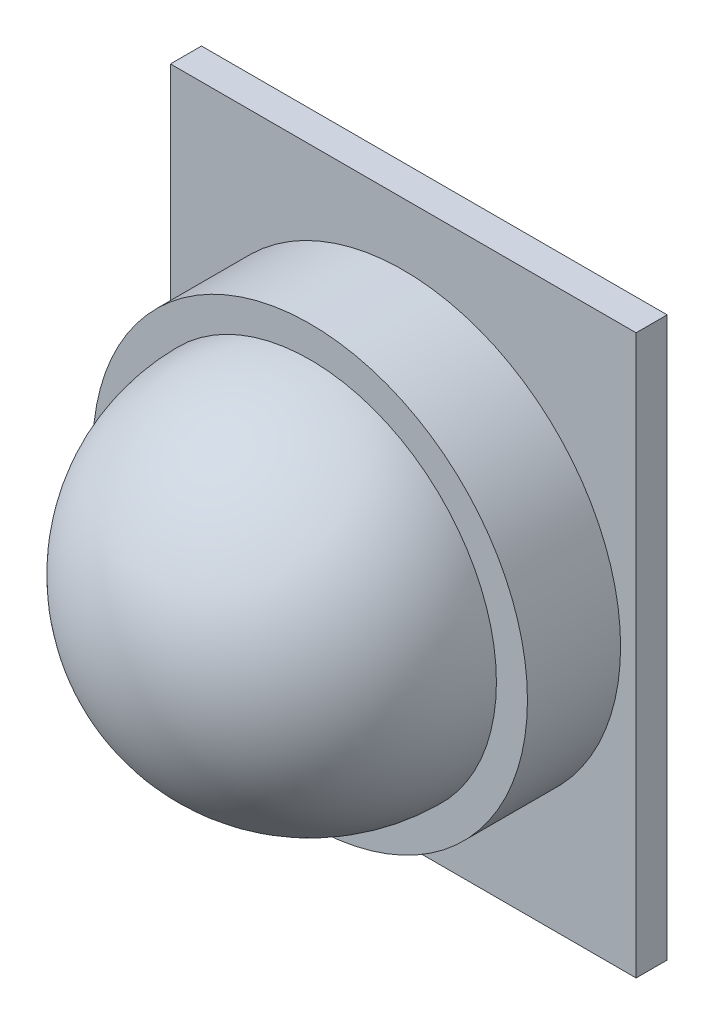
from build123d import *

# Parameters (mm, degrees)
ESQUISSE1_W       = 7.5
ESQUISSE1_H       = 9
EXTRUSION1_DEPTH  = 0.5
ESQUISSE2_R       = 3.5
EXTRUSION2_DEPTH  = 1.5
R_VOLUTION3_ANGLE = 180


with BuildPart() as part:
    # Esquisse1 → Extrusion1 (new body)
    with BuildSketch(Plane.XY):
        Rectangle(ESQUISSE1_W, ESQUISSE1_H)
    extrude(amount=EXTRUSION1_DEPTH)

    # Esquisse2 → Extrusion2 (add)
    with BuildSketch(Plane.XY.offset(0.5)):
        Circle(ESQUISSE2_R)
    extrude(amount=EXTRUSION2_DEPTH)

    # Esquisse4 → R_volution3 (revolve)
    with BuildSketch(Plane.XY.offset(2)):
        with BuildLine():
            Line((0, -3), (0, 3))
            ThreePointArc((0, 3), (3, 0), (0, -3))
        make_face()
    revolve(axis=Axis((0, -3, 2), (0, -1, 0)), revolution_arc=R_VOLUTION3_ANGLE)


solid = part.part
